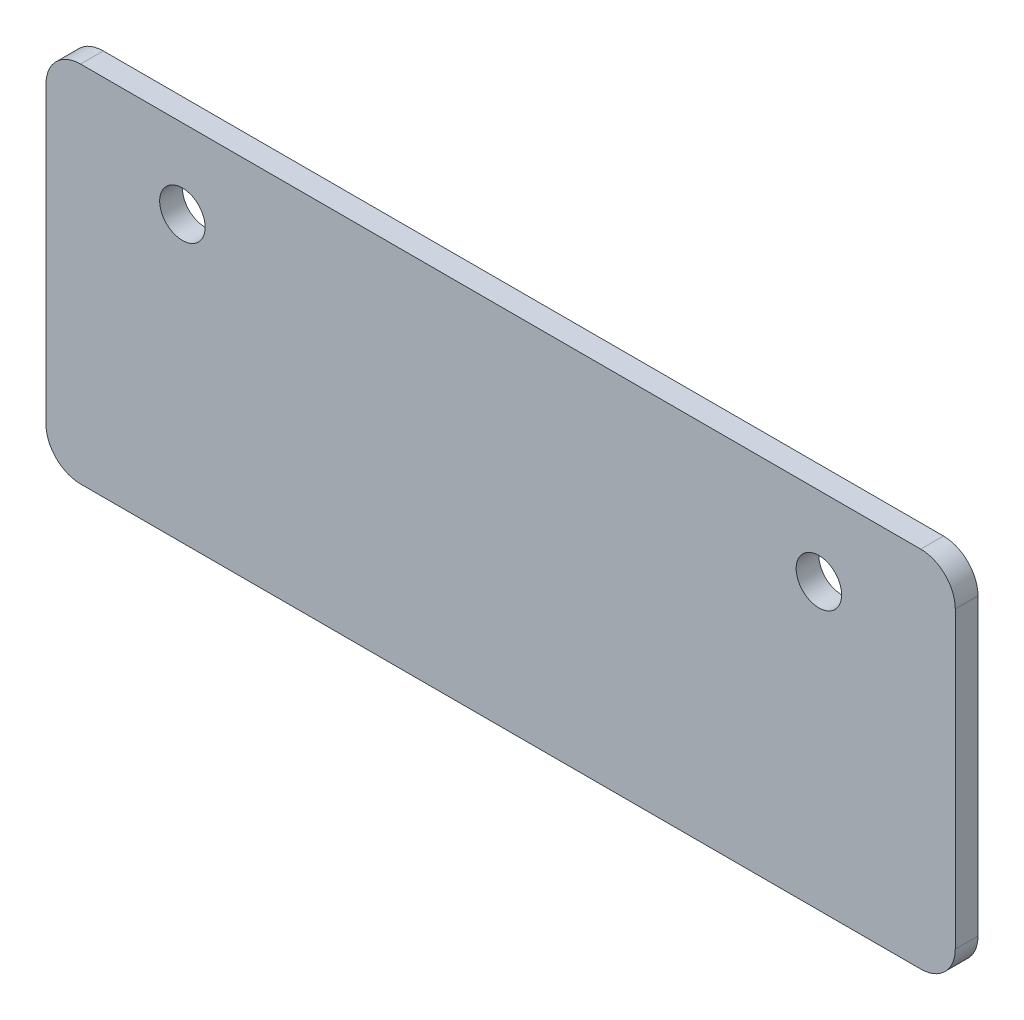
ISO-10303-21;
HEADER;
FILE_DESCRIPTION(('STEP AP214'),'2;1');
FILE_NAME('part.step','',(''),(''),'','','');
FILE_SCHEMA(('AUTOMOTIVE_DESIGN { 1 0 10303 214 1 1 1 1 }'));
ENDSEC;
DATA;
#1=APPLICATION_CONTEXT('core data for automotive mechanical design processes');
#2=APPLICATION_PROTOCOL_DEFINITION('international standard','automotive_design',2000,#1);
#3=PRODUCT_CONTEXT('',#1,'mechanical');
#4=PRODUCT('Part','Part','',(#3));
#5=PRODUCT_RELATED_PRODUCT_CATEGORY('part','',(#4));
#6=PRODUCT_DEFINITION_FORMATION('','',#4);
#7=PRODUCT_DEFINITION_CONTEXT('part definition',#1,'design');
#8=PRODUCT_DEFINITION('design','',#6,#7);
#9=PRODUCT_DEFINITION_SHAPE('','',#8);
#10=(LENGTH_UNIT() NAMED_UNIT(*) SI_UNIT(.MILLI.,.METRE.));
#11=(NAMED_UNIT(*) PLANE_ANGLE_UNIT() SI_UNIT($,.RADIAN.));
#12=(NAMED_UNIT(*) SI_UNIT($,.STERADIAN.) SOLID_ANGLE_UNIT());
#13=UNCERTAINTY_MEASURE_WITH_UNIT(LENGTH_MEASURE(1.E-05),#10,'distance_accuracy_value','');
#14=(GEOMETRIC_REPRESENTATION_CONTEXT(3) GLOBAL_UNCERTAINTY_ASSIGNED_CONTEXT((#13)) GLOBAL_UNIT_ASSIGNED_CONTEXT((#10,
#11,#12)) REPRESENTATION_CONTEXT('',''));
#15=CARTESIAN_POINT('',(0.,0.,0.));
#16=DIRECTION('',(0.,0.,1.));
#17=DIRECTION('',(1.,0.,0.));
#18=AXIS2_PLACEMENT_3D('',#15,#16,#17);
#19=CARTESIAN_POINT('',(244.348,41.148,3.175));
#20=DIRECTION('',(0.,0.,-1.));
#21=DIRECTION('',(-1.,0.,0.));
#22=AXIS2_PLACEMENT_3D('',#19,#20,#21);
#23=PLANE('',#22);
#24=CARTESIAN_POINT('',(215.9,28.702,3.175));
#25=DIRECTION('',(0.,0.,1.));
#26=DIRECTION('',(1.,0.,0.));
#27=AXIS2_PLACEMENT_3D('',#24,#25,#26);
#28=CIRCLE('',#27,6.35);
#29=CARTESIAN_POINT('',(222.25,28.702,3.175));
#30=VERTEX_POINT('',#29);
#31=EDGE_CURVE('E110',#30,#30,#28,.T.);
#32=ORIENTED_EDGE('',*,*,#31,.F.);
#33=EDGE_LOOP('',(#32));
#34=FACE_BOUND('',#33,.T.);
#35=CARTESIAN_POINT('',(244.348,41.148,3.175));
#36=DIRECTION('',(0.,0.,1.));
#37=DIRECTION('',(-1.,0.,0.));
#38=AXIS2_PLACEMENT_3D('',#35,#36,#37);
#39=CIRCLE('',#38,9.652);
#40=CARTESIAN_POINT('',(254.,41.148,3.175));
#41=VERTEX_POINT('',#40);
#42=CARTESIAN_POINT('',(244.348,50.8,3.175));
#43=VERTEX_POINT('',#42);
#44=EDGE_CURVE('E128',#41,#43,#39,.T.);
#45=ORIENTED_EDGE('',*,*,#44,.T.);
#46=DIRECTION('',(-1.,0.,0.));
#47=VECTOR('',#46,1.);
#48=CARTESIAN_POINT('',(9.65199999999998,50.8,3.175));
#49=LINE('',#48,#47);
#50=CARTESIAN_POINT('',(9.65199999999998,50.8,3.175));
#51=VERTEX_POINT('',#50);
#52=EDGE_CURVE('E105',#43,#51,#49,.T.);
#53=ORIENTED_EDGE('',*,*,#52,.T.);
#54=CARTESIAN_POINT('',(9.65199999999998,41.148,3.175));
#55=DIRECTION('',(0.,0.,1.));
#56=DIRECTION('',(-1.,0.,0.));
#57=AXIS2_PLACEMENT_3D('',#54,#55,#56);
#58=CIRCLE('',#57,9.652);
#59=CARTESIAN_POINT('',(0.,41.148,3.175));
#60=VERTEX_POINT('',#59);
#61=EDGE_CURVE('E131',#51,#60,#58,.T.);
#62=ORIENTED_EDGE('',*,*,#61,.T.);
#63=DIRECTION('',(0.,-1.,0.));
#64=VECTOR('',#63,1.);
#65=CARTESIAN_POINT('',(0.,-41.148,3.175));
#66=LINE('',#65,#64);
#67=CARTESIAN_POINT('',(0.,-41.148,3.175));
#68=VERTEX_POINT('',#67);
#69=EDGE_CURVE('E133',#60,#68,#66,.T.);
#70=ORIENTED_EDGE('',*,*,#69,.T.);
#71=CARTESIAN_POINT('',(9.652,-41.148,3.175));
#72=DIRECTION('',(0.,0.,1.));
#73=DIRECTION('',(-1.,0.,0.));
#74=AXIS2_PLACEMENT_3D('',#71,#72,#73);
#75=CIRCLE('',#74,9.652);
#76=CARTESIAN_POINT('',(9.652,-50.8,3.175));
#77=VERTEX_POINT('',#76);
#78=EDGE_CURVE('E135',#68,#77,#75,.T.);
#79=ORIENTED_EDGE('',*,*,#78,.T.);
#80=DIRECTION('',(1.,0.,0.));
#81=VECTOR('',#80,1.);
#82=CARTESIAN_POINT('',(244.348,-50.7999999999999,3.175));
#83=LINE('',#82,#81);
#84=CARTESIAN_POINT('',(244.348,-50.7999999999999,3.175));
#85=VERTEX_POINT('',#84);
#86=EDGE_CURVE('E137',#77,#85,#83,.T.);
#87=ORIENTED_EDGE('',*,*,#86,.T.);
#88=CARTESIAN_POINT('',(244.348,-41.1479999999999,3.175));
#89=DIRECTION('',(0.,0.,1.));
#90=DIRECTION('',(-1.,0.,0.));
#91=AXIS2_PLACEMENT_3D('',#88,#89,#90);
#92=CIRCLE('',#91,9.65199999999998);
#93=CARTESIAN_POINT('',(254.,-41.1479999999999,3.175));
#94=VERTEX_POINT('',#93);
#95=EDGE_CURVE('E46',#85,#94,#92,.T.);
#96=ORIENTED_EDGE('',*,*,#95,.T.);
#97=DIRECTION('',(0.,1.,0.));
#98=VECTOR('',#97,1.);
#99=CARTESIAN_POINT('',(254.,41.148,3.175));
#100=LINE('',#99,#98);
#101=EDGE_CURVE('E41',#94,#41,#100,.T.);
#102=ORIENTED_EDGE('',*,*,#101,.T.);
#103=EDGE_LOOP('',(#45,#53,#62,#70,#79,#87,#96,#102));
#104=FACE_BOUND('',#103,.T.);
#105=CARTESIAN_POINT('',(38.1,28.702,3.175));
#106=DIRECTION('',(0.,0.,1.));
#107=DIRECTION('',(1.,0.,0.));
#108=AXIS2_PLACEMENT_3D('',#105,#106,#107);
#109=CIRCLE('',#108,6.35000000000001);
#110=CARTESIAN_POINT('',(44.45,28.702,3.175));
#111=VERTEX_POINT('',#110);
#112=EDGE_CURVE('E208',#111,#111,#109,.T.);
#113=ORIENTED_EDGE('',*,*,#112,.F.);
#114=EDGE_LOOP('',(#113));
#115=FACE_BOUND('',#114,.T.);
#116=ADVANCED_FACE('F26',(#34,#104,#115),#23,.F.);
#117=CARTESIAN_POINT('',(244.348,41.148,-3.175));
#118=DIRECTION('',(0.,0.,-1.));
#119=DIRECTION('',(-1.,0.,0.));
#120=AXIS2_PLACEMENT_3D('',#117,#118,#119);
#121=PLANE('',#120);
#122=CARTESIAN_POINT('',(215.9,28.702,-3.175));
#123=DIRECTION('',(0.,0.,1.));
#124=DIRECTION('',(1.,0.,0.));
#125=AXIS2_PLACEMENT_3D('',#122,#123,#124);
#126=CIRCLE('',#125,6.35);
#127=CARTESIAN_POINT('',(222.25,28.702,-3.175));
#128=VERTEX_POINT('',#127);
#129=EDGE_CURVE('E113',#128,#128,#126,.T.);
#130=ORIENTED_EDGE('',*,*,#129,.T.);
#131=EDGE_LOOP('',(#130));
#132=FACE_BOUND('',#131,.T.);
#133=CARTESIAN_POINT('',(244.348,41.148,-3.175));
#134=DIRECTION('',(0.,0.,1.));
#135=DIRECTION('',(-1.,0.,0.));
#136=AXIS2_PLACEMENT_3D('',#133,#134,#135);
#137=CIRCLE('',#136,9.652);
#138=CARTESIAN_POINT('',(254.,41.148,-3.175));
#139=VERTEX_POINT('',#138);
#140=CARTESIAN_POINT('',(244.348,50.8,-3.175));
#141=VERTEX_POINT('',#140);
#142=EDGE_CURVE('E96',#139,#141,#137,.T.);
#143=ORIENTED_EDGE('',*,*,#142,.F.);
#144=DIRECTION('',(0.,1.,0.));
#145=VECTOR('',#144,1.);
#146=CARTESIAN_POINT('',(254.,41.148,-3.175));
#147=LINE('',#146,#145);
#148=CARTESIAN_POINT('',(254.,-41.1479999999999,-3.175));
#149=VERTEX_POINT('',#148);
#150=EDGE_CURVE('E126',#149,#139,#147,.T.);
#151=ORIENTED_EDGE('',*,*,#150,.F.);
#152=CARTESIAN_POINT('',(244.348,-41.1479999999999,-3.175));
#153=DIRECTION('',(0.,0.,1.));
#154=DIRECTION('',(-1.,0.,0.));
#155=AXIS2_PLACEMENT_3D('',#152,#153,#154);
#156=CIRCLE('',#155,9.65199999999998);
#157=CARTESIAN_POINT('',(244.348,-50.7999999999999,-3.175));
#158=VERTEX_POINT('',#157);
#159=EDGE_CURVE('E124',#158,#149,#156,.T.);
#160=ORIENTED_EDGE('',*,*,#159,.F.);
#161=DIRECTION('',(1.,0.,0.));
#162=VECTOR('',#161,1.);
#163=CARTESIAN_POINT('',(244.348,-50.7999999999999,-3.175));
#164=LINE('',#163,#162);
#165=CARTESIAN_POINT('',(9.652,-50.8,-3.175));
#166=VERTEX_POINT('',#165);
#167=EDGE_CURVE('E122',#166,#158,#164,.T.);
#168=ORIENTED_EDGE('',*,*,#167,.F.);
#169=CARTESIAN_POINT('',(9.652,-41.148,-3.175));
#170=DIRECTION('',(0.,0.,1.));
#171=DIRECTION('',(-1.,0.,0.));
#172=AXIS2_PLACEMENT_3D('',#169,#170,#171);
#173=CIRCLE('',#172,9.652);
#174=CARTESIAN_POINT('',(0.,-41.148,-3.175));
#175=VERTEX_POINT('',#174);
#176=EDGE_CURVE('E120',#175,#166,#173,.T.);
#177=ORIENTED_EDGE('',*,*,#176,.F.);
#178=DIRECTION('',(0.,-1.,0.));
#179=VECTOR('',#178,1.);
#180=CARTESIAN_POINT('',(0.,-41.148,-3.175));
#181=LINE('',#180,#179);
#182=CARTESIAN_POINT('',(0.,41.148,-3.175));
#183=VERTEX_POINT('',#182);
#184=EDGE_CURVE('E118',#183,#175,#181,.T.);
#185=ORIENTED_EDGE('',*,*,#184,.F.);
#186=CARTESIAN_POINT('',(9.65199999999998,41.148,-3.175));
#187=DIRECTION('',(0.,0.,1.));
#188=DIRECTION('',(-1.,0.,0.));
#189=AXIS2_PLACEMENT_3D('',#186,#187,#188);
#190=CIRCLE('',#189,9.652);
#191=CARTESIAN_POINT('',(9.65199999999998,50.8,-3.175));
#192=VERTEX_POINT('',#191);
#193=EDGE_CURVE('E98',#192,#183,#190,.T.);
#194=ORIENTED_EDGE('',*,*,#193,.F.);
#195=DIRECTION('',(-1.,0.,0.));
#196=VECTOR('',#195,1.);
#197=CARTESIAN_POINT('',(9.65199999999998,50.8,-3.175));
#198=LINE('',#197,#196);
#199=EDGE_CURVE('E91',#141,#192,#198,.T.);
#200=ORIENTED_EDGE('',*,*,#199,.F.);
#201=EDGE_LOOP('',(#143,#151,#160,#168,#177,#185,#194,#200));
#202=FACE_BOUND('',#201,.T.);
#203=CARTESIAN_POINT('',(38.1,28.702,-3.175));
#204=DIRECTION('',(0.,0.,1.));
#205=DIRECTION('',(1.,0.,0.));
#206=AXIS2_PLACEMENT_3D('',#203,#204,#205);
#207=CIRCLE('',#206,6.35000000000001);
#208=CARTESIAN_POINT('',(44.45,28.702,-3.175));
#209=VERTEX_POINT('',#208);
#210=EDGE_CURVE('E211',#209,#209,#207,.T.);
#211=ORIENTED_EDGE('',*,*,#210,.T.);
#212=EDGE_LOOP('',(#211));
#213=FACE_BOUND('',#212,.T.);
#214=ADVANCED_FACE('F92',(#132,#202,#213),#121,.T.);
#215=CARTESIAN_POINT('',(244.348,41.148,3.175));
#216=DIRECTION('',(0.,0.,-1.));
#217=DIRECTION('',(-1.,0.,0.));
#218=AXIS2_PLACEMENT_3D('',#215,#216,#217);
#219=CYLINDRICAL_SURFACE('',#218,9.652);
#220=ORIENTED_EDGE('',*,*,#142,.T.);
#221=DIRECTION('',(0.,0.,-1.));
#222=VECTOR('',#221,1.);
#223=CARTESIAN_POINT('',(244.348,50.8,3.175));
#224=LINE('',#223,#222);
#225=EDGE_CURVE('E11',#43,#141,#224,.T.);
#226=ORIENTED_EDGE('',*,*,#225,.F.);
#227=ORIENTED_EDGE('',*,*,#44,.F.);
#228=DIRECTION('',(0.,0.,-1.));
#229=VECTOR('',#228,1.);
#230=CARTESIAN_POINT('',(254.,41.148,3.175));
#231=LINE('',#230,#229);
#232=EDGE_CURVE('E109',#41,#139,#231,.T.);
#233=ORIENTED_EDGE('',*,*,#232,.T.);
#234=EDGE_LOOP('',(#220,#226,#227,#233));
#235=FACE_BOUND('',#234,.T.);
#236=ADVANCED_FACE('F28',(#235),#219,.T.);
#237=CARTESIAN_POINT('',(9.65199999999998,50.8,3.175));
#238=DIRECTION('',(0.,-1.,0.));
#239=DIRECTION('',(0.,0.,-1.));
#240=AXIS2_PLACEMENT_3D('',#237,#238,#239);
#241=PLANE('',#240);
#242=ORIENTED_EDGE('',*,*,#199,.T.);
#243=DIRECTION('',(0.,0.,-1.));
#244=VECTOR('',#243,1.);
#245=CARTESIAN_POINT('',(9.65199999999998,50.8,3.175));
#246=LINE('',#245,#244);
#247=EDGE_CURVE('E34',#51,#192,#246,.T.);
#248=ORIENTED_EDGE('',*,*,#247,.F.);
#249=ORIENTED_EDGE('',*,*,#52,.F.);
#250=ORIENTED_EDGE('',*,*,#225,.T.);
#251=EDGE_LOOP('',(#242,#248,#249,#250));
#252=FACE_BOUND('',#251,.T.);
#253=ADVANCED_FACE('F104',(#252),#241,.F.);
#254=CARTESIAN_POINT('',(9.65199999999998,41.148,3.175));
#255=DIRECTION('',(0.,0.,-1.));
#256=DIRECTION('',(-1.,0.,0.));
#257=AXIS2_PLACEMENT_3D('',#254,#255,#256);
#258=CYLINDRICAL_SURFACE('',#257,9.652);
#259=ORIENTED_EDGE('',*,*,#193,.T.);
#260=DIRECTION('',(0.,0.,-1.));
#261=VECTOR('',#260,1.);
#262=CARTESIAN_POINT('',(0.,41.148,3.175));
#263=LINE('',#262,#261);
#264=EDGE_CURVE('E154',#60,#183,#263,.T.);
#265=ORIENTED_EDGE('',*,*,#264,.F.);
#266=ORIENTED_EDGE('',*,*,#61,.F.);
#267=ORIENTED_EDGE('',*,*,#247,.T.);
#268=EDGE_LOOP('',(#259,#265,#266,#267));
#269=FACE_BOUND('',#268,.T.);
#270=ADVANCED_FACE('F158',(#269),#258,.T.);
#271=CARTESIAN_POINT('',(0.,-41.148,3.175));
#272=DIRECTION('',(1.,0.,0.));
#273=DIRECTION('',(0.,1.,0.));
#274=AXIS2_PLACEMENT_3D('',#271,#272,#273);
#275=PLANE('',#274);
#276=ORIENTED_EDGE('',*,*,#184,.T.);
#277=DIRECTION('',(0.,0.,-1.));
#278=VECTOR('',#277,1.);
#279=CARTESIAN_POINT('',(0.,-41.148,3.175));
#280=LINE('',#279,#278);
#281=EDGE_CURVE('E151',#68,#175,#280,.T.);
#282=ORIENTED_EDGE('',*,*,#281,.F.);
#283=ORIENTED_EDGE('',*,*,#69,.F.);
#284=ORIENTED_EDGE('',*,*,#264,.T.);
#285=EDGE_LOOP('',(#276,#282,#283,#284));
#286=FACE_BOUND('',#285,.T.);
#287=ADVANCED_FACE('F166',(#286),#275,.F.);
#288=CARTESIAN_POINT('',(9.652,-41.148,3.175));
#289=DIRECTION('',(0.,0.,-1.));
#290=DIRECTION('',(-1.,0.,0.));
#291=AXIS2_PLACEMENT_3D('',#288,#289,#290);
#292=CYLINDRICAL_SURFACE('',#291,9.652);
#293=ORIENTED_EDGE('',*,*,#176,.T.);
#294=DIRECTION('',(0.,0.,-1.));
#295=VECTOR('',#294,1.);
#296=CARTESIAN_POINT('',(9.652,-50.8,3.175));
#297=LINE('',#296,#295);
#298=EDGE_CURVE('E148',#77,#166,#297,.T.);
#299=ORIENTED_EDGE('',*,*,#298,.F.);
#300=ORIENTED_EDGE('',*,*,#78,.F.);
#301=ORIENTED_EDGE('',*,*,#281,.T.);
#302=EDGE_LOOP('',(#293,#299,#300,#301));
#303=FACE_BOUND('',#302,.T.);
#304=ADVANCED_FACE('F169',(#303),#292,.T.);
#305=CARTESIAN_POINT('',(244.348,-50.7999999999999,3.175));
#306=DIRECTION('',(0.,1.,0.));
#307=DIRECTION('',(-1.,0.,0.));
#308=AXIS2_PLACEMENT_3D('',#305,#306,#307);
#309=PLANE('',#308);
#310=ORIENTED_EDGE('',*,*,#167,.T.);
#311=DIRECTION('',(0.,0.,-1.));
#312=VECTOR('',#311,1.);
#313=CARTESIAN_POINT('',(244.348,-50.7999999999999,3.175));
#314=LINE('',#313,#312);
#315=EDGE_CURVE('E145',#85,#158,#314,.T.);
#316=ORIENTED_EDGE('',*,*,#315,.F.);
#317=ORIENTED_EDGE('',*,*,#86,.F.);
#318=ORIENTED_EDGE('',*,*,#298,.T.);
#319=EDGE_LOOP('',(#310,#316,#317,#318));
#320=FACE_BOUND('',#319,.T.);
#321=ADVANCED_FACE('F174',(#320),#309,.F.);
#322=CARTESIAN_POINT('',(244.348,-41.1479999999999,3.175));
#323=DIRECTION('',(0.,0.,-1.));
#324=DIRECTION('',(-1.,0.,0.));
#325=AXIS2_PLACEMENT_3D('',#322,#323,#324);
#326=CYLINDRICAL_SURFACE('',#325,9.65199999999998);
#327=ORIENTED_EDGE('',*,*,#159,.T.);
#328=DIRECTION('',(0.,0.,-1.));
#329=VECTOR('',#328,1.);
#330=CARTESIAN_POINT('',(254.,-41.1479999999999,3.175));
#331=LINE('',#330,#329);
#332=EDGE_CURVE('E142',#94,#149,#331,.T.);
#333=ORIENTED_EDGE('',*,*,#332,.F.);
#334=ORIENTED_EDGE('',*,*,#95,.F.);
#335=ORIENTED_EDGE('',*,*,#315,.T.);
#336=EDGE_LOOP('',(#327,#333,#334,#335));
#337=FACE_BOUND('',#336,.T.);
#338=ADVANCED_FACE('F177',(#337),#326,.T.);
#339=CARTESIAN_POINT('',(254.,41.148,3.175));
#340=DIRECTION('',(-1.,0.,0.));
#341=DIRECTION('',(0.,0.,1.));
#342=AXIS2_PLACEMENT_3D('',#339,#340,#341);
#343=PLANE('',#342);
#344=ORIENTED_EDGE('',*,*,#150,.T.);
#345=ORIENTED_EDGE('',*,*,#232,.F.);
#346=ORIENTED_EDGE('',*,*,#101,.F.);
#347=ORIENTED_EDGE('',*,*,#332,.T.);
#348=EDGE_LOOP('',(#344,#345,#346,#347));
#349=FACE_BOUND('',#348,.T.);
#350=ADVANCED_FACE('F179',(#349),#343,.F.);
#351=CARTESIAN_POINT('',(215.9,28.702,3.175));
#352=DIRECTION('',(0.,0.,-1.));
#353=DIRECTION('',(-1.,0.,0.));
#354=AXIS2_PLACEMENT_3D('',#351,#352,#353);
#355=CYLINDRICAL_SURFACE('',#354,6.35);
#356=ORIENTED_EDGE('',*,*,#31,.T.);
#357=EDGE_LOOP('',(#356));
#358=FACE_BOUND('',#357,.T.);
#359=ORIENTED_EDGE('',*,*,#129,.F.);
#360=EDGE_LOOP('',(#359));
#361=FACE_BOUND('',#360,.T.);
#362=ADVANCED_FACE('F181',(#358,#361),#355,.F.);
#363=CARTESIAN_POINT('',(38.1,28.702,3.175));
#364=DIRECTION('',(0.,0.,-1.));
#365=DIRECTION('',(-1.,0.,0.));
#366=AXIS2_PLACEMENT_3D('',#363,#364,#365);
#367=CYLINDRICAL_SURFACE('',#366,6.35000000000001);
#368=ORIENTED_EDGE('',*,*,#112,.T.);
#369=EDGE_LOOP('',(#368));
#370=FACE_BOUND('',#369,.T.);
#371=ORIENTED_EDGE('',*,*,#210,.F.);
#372=EDGE_LOOP('',(#371));
#373=FACE_BOUND('',#372,.T.);
#374=ADVANCED_FACE('F187',(#370,#373),#367,.F.);
#375=CLOSED_SHELL('',(#116,#214,#236,#253,#270,#287,#304,#321,#338,#350,#362,#374));
#376=MANIFOLD_SOLID_BREP('B2',#375);
#377=ADVANCED_BREP_SHAPE_REPRESENTATION('',(#18,#376),#14);
#378=SHAPE_DEFINITION_REPRESENTATION(#9,#377);
ENDSEC;
END-ISO-10303-21;
